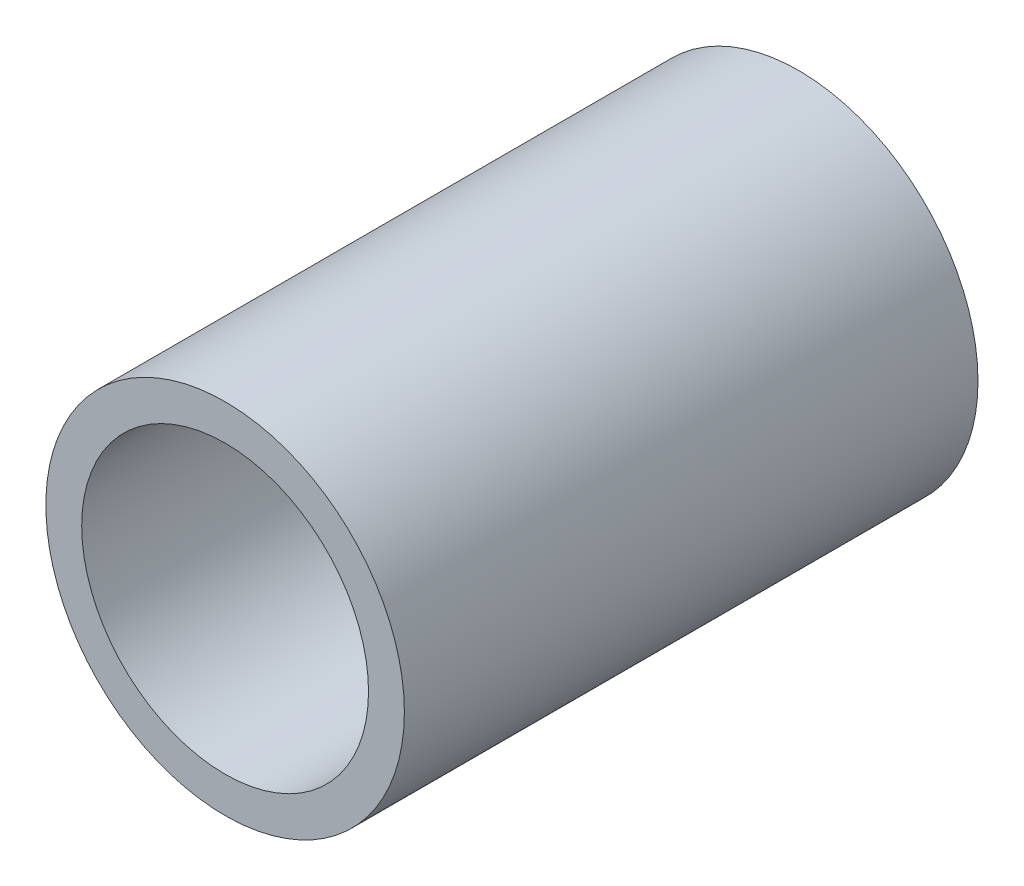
ISO-10303-21;
HEADER;
FILE_DESCRIPTION(('STEP AP214'),'2;1');
FILE_NAME('part.step','',(''),(''),'','','');
FILE_SCHEMA(('AUTOMOTIVE_DESIGN { 1 0 10303 214 1 1 1 1 }'));
ENDSEC;
DATA;
#1=APPLICATION_CONTEXT('core data for automotive mechanical design processes');
#2=APPLICATION_PROTOCOL_DEFINITION('international standard','automotive_design',2000,#1);
#3=PRODUCT_CONTEXT('',#1,'mechanical');
#4=PRODUCT('Part','Part','',(#3));
#5=PRODUCT_RELATED_PRODUCT_CATEGORY('part','',(#4));
#6=PRODUCT_DEFINITION_FORMATION('','',#4);
#7=PRODUCT_DEFINITION_CONTEXT('part definition',#1,'design');
#8=PRODUCT_DEFINITION('design','',#6,#7);
#9=PRODUCT_DEFINITION_SHAPE('','',#8);
#10=(LENGTH_UNIT() NAMED_UNIT(*) SI_UNIT(.MILLI.,.METRE.));
#11=(NAMED_UNIT(*) PLANE_ANGLE_UNIT() SI_UNIT($,.RADIAN.));
#12=(NAMED_UNIT(*) SI_UNIT($,.STERADIAN.) SOLID_ANGLE_UNIT());
#13=UNCERTAINTY_MEASURE_WITH_UNIT(LENGTH_MEASURE(1.E-05),#10,'distance_accuracy_value','');
#14=(GEOMETRIC_REPRESENTATION_CONTEXT(3) GLOBAL_UNCERTAINTY_ASSIGNED_CONTEXT((#13)) GLOBAL_UNIT_ASSIGNED_CONTEXT((#10,
#11,#12)) REPRESENTATION_CONTEXT('',''));
#15=CARTESIAN_POINT('',(0.,0.,0.));
#16=DIRECTION('',(0.,0.,1.));
#17=DIRECTION('',(1.,0.,0.));
#18=AXIS2_PLACEMENT_3D('',#15,#16,#17);
#19=CARTESIAN_POINT('',(8.32667268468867E-13,0.,200.));
#20=DIRECTION('',(0.,0.,1.));
#21=DIRECTION('',(0.999999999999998,0.,0.));
#22=AXIS2_PLACEMENT_3D('',#19,#20,#21);
#23=PLANE('',#22);
#24=CARTESIAN_POINT('',(8.32667268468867E-13,0.,200.));
#25=DIRECTION('',(0.,0.,1.));
#26=DIRECTION('',(0.999999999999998,0.,0.));
#27=AXIS2_PLACEMENT_3D('',#24,#25,#26);
#28=CIRCLE('',#27,62.5);
#29=CARTESIAN_POINT('',(62.5000000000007,-1.87350135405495E-13,200.));
#30=VERTEX_POINT('',#29);
#31=EDGE_CURVE('E10',#30,#30,#28,.T.);
#32=ORIENTED_EDGE('',*,*,#31,.T.);
#33=EDGE_LOOP('',(#32));
#34=FACE_BOUND('',#33,.T.);
#35=CARTESIAN_POINT('',(8.32667268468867E-13,0.,200.));
#36=DIRECTION('',(0.,0.,1.));
#37=DIRECTION('',(0.999999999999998,0.,0.));
#38=AXIS2_PLACEMENT_3D('',#35,#36,#37);
#39=CIRCLE('',#38,50.);
#40=CARTESIAN_POINT('',(50.0000000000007,-1.38777878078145E-13,200.));
#41=VERTEX_POINT('',#40);
#42=EDGE_CURVE('E41',#41,#41,#39,.T.);
#43=ORIENTED_EDGE('',*,*,#42,.F.);
#44=EDGE_LOOP('',(#43));
#45=FACE_BOUND('',#44,.T.);
#46=ADVANCED_FACE('F30',(#34,#45),#23,.T.);
#47=CARTESIAN_POINT('',(0.,0.,0.));
#48=DIRECTION('',(0.,0.,1.));
#49=DIRECTION('',(0.999999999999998,0.,0.));
#50=AXIS2_PLACEMENT_3D('',#47,#48,#49);
#51=PLANE('',#50);
#52=CARTESIAN_POINT('',(0.,0.,0.));
#53=DIRECTION('',(0.,0.,1.));
#54=DIRECTION('',(0.999999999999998,0.,0.));
#55=AXIS2_PLACEMENT_3D('',#52,#53,#54);
#56=CIRCLE('',#55,62.5);
#57=CARTESIAN_POINT('',(62.4999999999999,-2.42861286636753E-13,0.));
#58=VERTEX_POINT('',#57);
#59=EDGE_CURVE('E37',#58,#58,#56,.T.);
#60=ORIENTED_EDGE('',*,*,#59,.F.);
#61=EDGE_LOOP('',(#60));
#62=FACE_BOUND('',#61,.T.);
#63=CARTESIAN_POINT('',(0.,0.,0.));
#64=DIRECTION('',(0.,0.,1.));
#65=DIRECTION('',(0.999999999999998,0.,0.));
#66=AXIS2_PLACEMENT_3D('',#63,#64,#65);
#67=CIRCLE('',#66,50.);
#68=CARTESIAN_POINT('',(49.9999999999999,-1.94289029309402E-13,0.));
#69=VERTEX_POINT('',#68);
#70=EDGE_CURVE('E45',#69,#69,#67,.T.);
#71=ORIENTED_EDGE('',*,*,#70,.T.);
#72=EDGE_LOOP('',(#71));
#73=FACE_BOUND('',#72,.T.);
#74=ADVANCED_FACE('F51',(#62,#73),#51,.F.);
#75=CARTESIAN_POINT('',(8.32667268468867E-13,0.,200.));
#76=DIRECTION('',(0.,0.,-1.));
#77=DIRECTION('',(-0.999999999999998,0.,0.));
#78=AXIS2_PLACEMENT_3D('',#75,#76,#77);
#79=CYLINDRICAL_SURFACE('',#78,62.5);
#80=ORIENTED_EDGE('',*,*,#31,.F.);
#81=EDGE_LOOP('',(#80));
#82=FACE_BOUND('',#81,.T.);
#83=ORIENTED_EDGE('',*,*,#59,.T.);
#84=EDGE_LOOP('',(#83));
#85=FACE_BOUND('',#84,.T.);
#86=ADVANCED_FACE('F32',(#82,#85),#79,.T.);
#87=CARTESIAN_POINT('',(8.32667268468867E-13,0.,200.));
#88=DIRECTION('',(0.,0.,-1.));
#89=DIRECTION('',(-0.999999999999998,0.,0.));
#90=AXIS2_PLACEMENT_3D('',#87,#88,#89);
#91=CYLINDRICAL_SURFACE('',#90,50.);
#92=ORIENTED_EDGE('',*,*,#42,.T.);
#93=EDGE_LOOP('',(#92));
#94=FACE_BOUND('',#93,.T.);
#95=ORIENTED_EDGE('',*,*,#70,.F.);
#96=EDGE_LOOP('',(#95));
#97=FACE_BOUND('',#96,.T.);
#98=ADVANCED_FACE('F53',(#94,#97),#91,.F.);
#99=CLOSED_SHELL('',(#46,#74,#86,#98));
#100=MANIFOLD_SOLID_BREP('B2',#99);
#101=ADVANCED_BREP_SHAPE_REPRESENTATION('',(#18,#100),#14);
#102=SHAPE_DEFINITION_REPRESENTATION(#9,#101);
ENDSEC;
END-ISO-10303-21;
